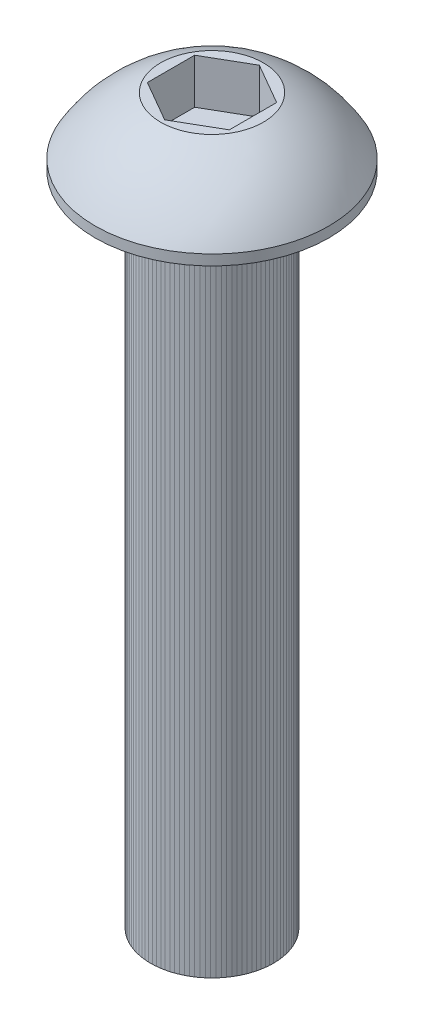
ISO-10303-21;
HEADER;
FILE_DESCRIPTION(('STEP AP214'),'2;1');
FILE_NAME('part.step','',(''),(''),'','','');
FILE_SCHEMA(('AUTOMOTIVE_DESIGN { 1 0 10303 214 1 1 1 1 }'));
ENDSEC;
DATA;
#1=APPLICATION_CONTEXT('core data for automotive mechanical design processes');
#2=APPLICATION_PROTOCOL_DEFINITION('international standard','automotive_design',2000,#1);
#3=PRODUCT_CONTEXT('',#1,'mechanical');
#4=PRODUCT('Part','Part','',(#3));
#5=PRODUCT_RELATED_PRODUCT_CATEGORY('part','',(#4));
#6=PRODUCT_DEFINITION_FORMATION('','',#4);
#7=PRODUCT_DEFINITION_CONTEXT('part definition',#1,'design');
#8=PRODUCT_DEFINITION('design','',#6,#7);
#9=PRODUCT_DEFINITION_SHAPE('','',#8);
#10=(LENGTH_UNIT() NAMED_UNIT(*) SI_UNIT(.MILLI.,.METRE.));
#11=(NAMED_UNIT(*) PLANE_ANGLE_UNIT() SI_UNIT($,.RADIAN.));
#12=(NAMED_UNIT(*) SI_UNIT($,.STERADIAN.) SOLID_ANGLE_UNIT());
#13=UNCERTAINTY_MEASURE_WITH_UNIT(LENGTH_MEASURE(1.E-05),#10,'distance_accuracy_value','');
#14=(GEOMETRIC_REPRESENTATION_CONTEXT(3) GLOBAL_UNCERTAINTY_ASSIGNED_CONTEXT((#13)) GLOBAL_UNIT_ASSIGNED_CONTEXT((#10,
#11,#12)) REPRESENTATION_CONTEXT('',''));
#15=CARTESIAN_POINT('',(0.,0.,0.));
#16=DIRECTION('',(0.,0.,1.));
#17=DIRECTION('',(1.,0.,0.));
#18=AXIS2_PLACEMENT_3D('',#15,#16,#17);
#19=CARTESIAN_POINT('',(0.,-16.,0.));
#20=DIRECTION('',(0.,1.,0.));
#21=DIRECTION('',(0.,0.,1.));
#22=AXIS2_PLACEMENT_3D('',#19,#20,#21);
#23=CYLINDRICAL_SURFACE('',#22,1.5);
#24=CARTESIAN_POINT('',(0.,0.,0.));
#25=DIRECTION('',(0.,1.,0.));
#26=DIRECTION('',(0.,0.,1.));
#27=AXIS2_PLACEMENT_3D('',#24,#25,#26);
#28=CIRCLE('',#27,1.5);
#29=CARTESIAN_POINT('',(0.,0.,1.5));
#30=VERTEX_POINT('',#29);
#31=EDGE_CURVE('P0_E16',#30,#30,#28,.F.);
#32=ORIENTED_EDGE('',*,*,#31,.T.);
#33=EDGE_LOOP('',(#32));
#34=FACE_BOUND('',#33,.T.);
#35=CARTESIAN_POINT('',(0.,-16.,0.));
#36=DIRECTION('',(0.,1.,0.));
#37=DIRECTION('',(0.,0.,1.));
#38=AXIS2_PLACEMENT_3D('',#35,#36,#37);
#39=CIRCLE('',#38,1.5);
#40=CARTESIAN_POINT('',(0.,-16.,1.5));
#41=VERTEX_POINT('',#40);
#42=EDGE_CURVE('P0_E10',#41,#41,#39,.T.);
#43=ORIENTED_EDGE('',*,*,#42,.T.);
#44=EDGE_LOOP('',(#43));
#45=FACE_BOUND('',#44,.T.);
#46=ADVANCED_FACE('P0_F15',(#34,#45),#23,.T.);
#47=OPEN_SHELL('',(#46));
#48=SHELL_BASED_SURFACE_MODEL('P0_B1',(#47));
#49=CARTESIAN_POINT('',(0.,0.55,0.));
#50=DIRECTION('',(0.,1.,0.));
#51=DIRECTION('',(0.,0.,1.));
#52=AXIS2_PLACEMENT_3D('',#49,#50,#51);
#53=PLANE('',#52);
#54=DIRECTION('',(0.866025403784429,0.,0.500000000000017));
#55=VECTOR('',#54,1.);
#56=CARTESIAN_POINT('',(-1.,0.55,0.5773502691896));
#57=LINE('',#56,#55);
#58=CARTESIAN_POINT('',(-1.,0.55,0.5773502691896));
#59=VERTEX_POINT('',#58);
#60=CARTESIAN_POINT('',(0.,0.55,1.15470053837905));
#61=VERTEX_POINT('',#60);
#62=EDGE_CURVE('P1_E92',#59,#61,#57,.T.);
#63=ORIENTED_EDGE('',*,*,#62,.T.);
#64=DIRECTION('',(0.866025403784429,0.,-0.500000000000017));
#65=VECTOR('',#64,1.);
#66=CARTESIAN_POINT('',(0.,0.55,1.154700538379));
#67=LINE('',#66,#65);
#68=CARTESIAN_POINT('',(0.999999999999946,0.55,0.577350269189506));
#69=VERTEX_POINT('',#68);
#70=EDGE_CURVE('P1_E89',#61,#69,#67,.T.);
#71=ORIENTED_EDGE('',*,*,#70,.T.);
#72=DIRECTION('',(0.,0.,-1.));
#73=VECTOR('',#72,1.);
#74=CARTESIAN_POINT('',(1.,0.55,0.5773502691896));
#75=LINE('',#74,#73);
#76=CARTESIAN_POINT('',(1.,0.55,-0.5773502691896));
#77=VERTEX_POINT('',#76);
#78=EDGE_CURVE('P1_E86',#69,#77,#75,.T.);
#79=ORIENTED_EDGE('',*,*,#78,.T.);
#80=DIRECTION('',(-0.866025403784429,0.,-0.500000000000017));
#81=VECTOR('',#80,1.);
#82=CARTESIAN_POINT('',(1.,0.55,-0.5773502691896));
#83=LINE('',#82,#81);
#84=CARTESIAN_POINT('',(0.,0.55,-1.15470053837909));
#85=VERTEX_POINT('',#84);
#86=EDGE_CURVE('P1_E115',#77,#85,#83,.T.);
#87=ORIENTED_EDGE('',*,*,#86,.T.);
#88=DIRECTION('',(-0.866025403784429,0.,0.500000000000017));
#89=VECTOR('',#88,1.);
#90=CARTESIAN_POINT('',(0.,0.55,-1.154700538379));
#91=LINE('',#90,#89);
#92=CARTESIAN_POINT('',(-0.999999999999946,0.55,-0.577350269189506));
#93=VERTEX_POINT('',#92);
#94=EDGE_CURVE('P1_E170',#85,#93,#91,.T.);
#95=ORIENTED_EDGE('',*,*,#94,.T.);
#96=DIRECTION('',(0.,0.,1.));
#97=VECTOR('',#96,1.);
#98=CARTESIAN_POINT('',(-1.,0.55,-0.5773502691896));
#99=LINE('',#98,#97);
#100=EDGE_CURVE('P1_E164',#93,#59,#99,.T.);
#101=ORIENTED_EDGE('',*,*,#100,.T.);
#102=EDGE_LOOP('',(#63,#71,#79,#87,#95,#101));
#103=FACE_BOUND('',#102,.T.);
#104=ADVANCED_FACE('P1_F17',(#103),#53,.T.);
#105=CARTESIAN_POINT('',(0.,1.65,1.154700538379));
#106=DIRECTION('',(0.500000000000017,0.,0.866025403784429));
#107=DIRECTION('',(0.866025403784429,0.,-0.500000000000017));
#108=AXIS2_PLACEMENT_3D('',#105,#106,#107);
#109=PLANE('',#108);
#110=ORIENTED_EDGE('',*,*,#70,.F.);
#111=DIRECTION('',(0.,1.,0.));
#112=VECTOR('',#111,1.);
#113=CARTESIAN_POINT('',(-1.08637057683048E-13,1.65,1.15470053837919));
#114=LINE('',#113,#112);
#115=CARTESIAN_POINT('',(0.,1.65,1.15470053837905));
#116=VERTEX_POINT('',#115);
#117=EDGE_CURVE('P1_E156',#61,#116,#114,.T.);
#118=ORIENTED_EDGE('',*,*,#117,.T.);
#119=DIRECTION('',(0.866025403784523,0.,-0.499999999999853));
#120=VECTOR('',#119,1.);
#121=CARTESIAN_POINT('',(0.,1.65,1.154700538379));
#122=LINE('',#121,#120);
#123=CARTESIAN_POINT('',(0.999999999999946,1.65,0.577350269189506));
#124=VERTEX_POINT('',#123);
#125=EDGE_CURVE('P1_E101',#116,#124,#122,.T.);
#126=ORIENTED_EDGE('',*,*,#125,.T.);
#127=DIRECTION('',(0.,1.,0.));
#128=VECTOR('',#127,1.);
#129=CARTESIAN_POINT('',(1.,1.65,0.5773502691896));
#130=LINE('',#129,#128);
#131=EDGE_CURVE('P1_E96',#124,#69,#130,.F.);
#132=ORIENTED_EDGE('',*,*,#131,.T.);
#133=EDGE_LOOP('',(#110,#118,#126,#132));
#134=FACE_BOUND('',#133,.T.);
#135=ADVANCED_FACE('P1_F99',(#134),#109,.F.);
#136=CARTESIAN_POINT('',(1.,1.65,0.5773502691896));
#137=DIRECTION('',(1.,0.,0.));
#138=DIRECTION('',(0.,0.,-1.));
#139=AXIS2_PLACEMENT_3D('',#136,#137,#138);
#140=PLANE('',#139);
#141=ORIENTED_EDGE('',*,*,#78,.F.);
#142=ORIENTED_EDGE('',*,*,#131,.F.);
#143=DIRECTION('',(0.,0.,-1.));
#144=VECTOR('',#143,1.);
#145=CARTESIAN_POINT('',(1.,1.65,0.));
#146=LINE('',#145,#144);
#147=CARTESIAN_POINT('',(1.,1.65,-0.5773502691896));
#148=VERTEX_POINT('',#147);
#149=EDGE_CURVE('P1_E151',#124,#148,#146,.T.);
#150=ORIENTED_EDGE('',*,*,#149,.T.);
#151=DIRECTION('',(0.,1.,0.));
#152=VECTOR('',#151,1.);
#153=CARTESIAN_POINT('',(1.,1.65,-0.5773502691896));
#154=LINE('',#153,#152);
#155=EDGE_CURVE('P1_E108',#148,#77,#154,.F.);
#156=ORIENTED_EDGE('',*,*,#155,.T.);
#157=EDGE_LOOP('',(#141,#142,#150,#156));
#158=FACE_BOUND('',#157,.T.);
#159=ADVANCED_FACE('P1_F106',(#158),#140,.F.);
#160=CARTESIAN_POINT('',(1.,1.65,-0.5773502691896));
#161=DIRECTION('',(0.500000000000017,0.,-0.866025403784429));
#162=DIRECTION('',(-0.866025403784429,0.,-0.500000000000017));
#163=AXIS2_PLACEMENT_3D('',#160,#161,#162);
#164=PLANE('',#163);
#165=ORIENTED_EDGE('',*,*,#86,.F.);
#166=ORIENTED_EDGE('',*,*,#155,.F.);
#167=DIRECTION('',(-0.866025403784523,0.,-0.499999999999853));
#168=VECTOR('',#167,1.);
#169=CARTESIAN_POINT('',(1.,1.65,-0.5773502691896));
#170=LINE('',#169,#168);
#171=CARTESIAN_POINT('',(0.,1.65,-1.15470053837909));
#172=VERTEX_POINT('',#171);
#173=EDGE_CURVE('P1_E148',#148,#172,#170,.T.);
#174=ORIENTED_EDGE('',*,*,#173,.T.);
#175=DIRECTION('',(0.,1.,0.));
#176=VECTOR('',#175,1.);
#177=CARTESIAN_POINT('',(0.,1.65,-1.154700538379));
#178=LINE('',#177,#176);
#179=EDGE_CURVE('P1_E173',#172,#85,#178,.F.);
#180=ORIENTED_EDGE('',*,*,#179,.T.);
#181=EDGE_LOOP('',(#165,#166,#174,#180));
#182=FACE_BOUND('',#181,.T.);
#183=ADVANCED_FACE('P1_F180',(#182),#164,.F.);
#184=CARTESIAN_POINT('',(0.,1.65,-1.154700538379));
#185=DIRECTION('',(-0.500000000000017,0.,-0.866025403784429));
#186=DIRECTION('',(-0.866025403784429,0.,0.500000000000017));
#187=AXIS2_PLACEMENT_3D('',#184,#185,#186);
#188=PLANE('',#187);
#189=ORIENTED_EDGE('',*,*,#94,.F.);
#190=ORIENTED_EDGE('',*,*,#179,.F.);
#191=DIRECTION('',(-0.866025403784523,0.,0.499999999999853));
#192=VECTOR('',#191,1.);
#193=CARTESIAN_POINT('',(0.,1.65,-1.154700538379));
#194=LINE('',#193,#192);
#195=CARTESIAN_POINT('',(-0.999999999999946,1.65,-0.577350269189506));
#196=VERTEX_POINT('',#195);
#197=EDGE_CURVE('P1_E142',#172,#196,#194,.T.);
#198=ORIENTED_EDGE('',*,*,#197,.T.);
#199=DIRECTION('',(0.,1.,0.));
#200=VECTOR('',#199,1.);
#201=CARTESIAN_POINT('',(-1.,1.65,-0.5773502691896));
#202=LINE('',#201,#200);
#203=EDGE_CURVE('P1_E167',#196,#93,#202,.F.);
#204=ORIENTED_EDGE('',*,*,#203,.T.);
#205=EDGE_LOOP('',(#189,#190,#198,#204));
#206=FACE_BOUND('',#205,.T.);
#207=ADVANCED_FACE('P1_F184',(#206),#188,.F.);
#208=CARTESIAN_POINT('',(-1.,1.65,-0.5773502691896));
#209=DIRECTION('',(-1.,0.,0.));
#210=DIRECTION('',(0.,0.,1.));
#211=AXIS2_PLACEMENT_3D('',#208,#209,#210);
#212=PLANE('',#211);
#213=ORIENTED_EDGE('',*,*,#100,.F.);
#214=ORIENTED_EDGE('',*,*,#203,.F.);
#215=DIRECTION('',(0.,0.,-1.));
#216=VECTOR('',#215,1.);
#217=CARTESIAN_POINT('',(-1.,1.65,0.));
#218=LINE('',#217,#216);
#219=CARTESIAN_POINT('',(-1.,1.65,0.5773502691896));
#220=VERTEX_POINT('',#219);
#221=EDGE_CURVE('P1_E44',#196,#220,#218,.F.);
#222=ORIENTED_EDGE('',*,*,#221,.T.);
#223=DIRECTION('',(0.,1.,0.));
#224=VECTOR('',#223,1.);
#225=CARTESIAN_POINT('',(-1.,1.65,0.5773502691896));
#226=LINE('',#225,#224);
#227=EDGE_CURVE('P1_E161',#220,#59,#226,.F.);
#228=ORIENTED_EDGE('',*,*,#227,.T.);
#229=EDGE_LOOP('',(#213,#214,#222,#228));
#230=FACE_BOUND('',#229,.T.);
#231=ADVANCED_FACE('P1_F186',(#230),#212,.F.);
#232=CARTESIAN_POINT('',(-1.,1.65,0.5773502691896));
#233=DIRECTION('',(-0.500000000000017,0.,0.866025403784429));
#234=DIRECTION('',(0.866025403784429,0.,0.500000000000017));
#235=AXIS2_PLACEMENT_3D('',#232,#233,#234);
#236=PLANE('',#235);
#237=ORIENTED_EDGE('',*,*,#62,.F.);
#238=ORIENTED_EDGE('',*,*,#227,.F.);
#239=DIRECTION('',(0.866025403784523,0.,0.499999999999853));
#240=VECTOR('',#239,1.);
#241=CARTESIAN_POINT('',(-1.,1.65,0.5773502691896));
#242=LINE('',#241,#240);
#243=EDGE_CURVE('P1_E131',#220,#116,#242,.T.);
#244=ORIENTED_EDGE('',*,*,#243,.T.);
#245=ORIENTED_EDGE('',*,*,#117,.F.);
#246=EDGE_LOOP('',(#237,#238,#244,#245));
#247=FACE_BOUND('',#246,.T.);
#248=ADVANCED_FACE('P1_F187',(#247),#236,.F.);
#249=CARTESIAN_POINT('',(0.,1.65,0.));
#250=DIRECTION('',(0.,-1.,0.));
#251=DIRECTION('',(0.,0.,-1.));
#252=AXIS2_PLACEMENT_3D('',#249,#250,#251);
#253=PLANE('',#252);
#254=ORIENTED_EDGE('',*,*,#221,.F.);
#255=ORIENTED_EDGE('',*,*,#197,.F.);
#256=ORIENTED_EDGE('',*,*,#173,.F.);
#257=ORIENTED_EDGE('',*,*,#149,.F.);
#258=ORIENTED_EDGE('',*,*,#125,.F.);
#259=ORIENTED_EDGE('',*,*,#243,.F.);
#260=EDGE_LOOP('',(#254,#255,#256,#257,#258,#259));
#261=FACE_BOUND('',#260,.T.);
#262=CARTESIAN_POINT('',(-1.25470053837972,1.65,0.));
#263=CARTESIAN_POINT('',(-1.2546965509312,1.64999999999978,-0.070424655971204));
#264=CARTESIAN_POINT('',(-1.24873864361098,1.64999999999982,-0.140974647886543));
#265=CARTESIAN_POINT('',(-1.23101016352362,1.65000000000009,-0.245237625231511));
#266=CARTESIAN_POINT('',(-1.22361994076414,1.65000000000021,-0.279775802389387));
#267=CARTESIAN_POINT('',(-1.20595086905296,1.64999999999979,-0.348140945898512));
#268=CARTESIAN_POINT('',(-1.19566967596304,1.64999999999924,-0.381967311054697));
#269=CARTESIAN_POINT('',(-1.16063107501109,1.64999999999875,-0.481845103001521));
#270=CARTESIAN_POINT('',(-1.13164986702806,1.64999999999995,-0.546463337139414));
#271=CARTESIAN_POINT('',(-1.0632361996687,1.65000000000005,-0.669911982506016));
#272=CARTESIAN_POINT('',(-1.02380334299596,1.64999999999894,-0.728742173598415));
#273=CARTESIAN_POINT('',(-0.957707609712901,1.64999999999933,-0.811368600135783));
#274=CARTESIAN_POINT('',(-0.934500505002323,1.6499999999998,-0.837989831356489));
#275=CARTESIAN_POINT('',(-0.885952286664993,1.6500000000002,-0.889159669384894));
#276=CARTESIAN_POINT('',(-0.86061325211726,1.65000000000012,-0.913710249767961));
#277=CARTESIAN_POINT('',(-0.78160082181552,1.64999999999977,-0.984041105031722));
#278=CARTESIAN_POINT('',(-0.724917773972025,1.6499999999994,-1.02651836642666));
#279=CARTESIAN_POINT('',(-0.605255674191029,1.64999999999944,-1.10132851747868));
#280=CARTESIAN_POINT('',(-0.542276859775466,1.64999999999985,-1.13366178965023));
#281=CARTESIAN_POINT('',(-0.411777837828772,1.65000000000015,-1.18730210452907));
#282=CARTESIAN_POINT('',(-0.344257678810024,1.65000000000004,-1.20860926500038));
#283=CARTESIAN_POINT('',(-0.206600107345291,1.64999999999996,-1.23958383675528));
#284=CARTESIAN_POINT('',(-0.136462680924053,1.64999999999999,-1.24925118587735));
#285=CARTESIAN_POINT('',(0.00443971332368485,1.65000000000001,-1.2566745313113));
#286=CARTESIAN_POINT('',(0.075204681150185,1.65,-1.25443052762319));
#287=CARTESIAN_POINT('',(0.21535490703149,1.65,-1.23809206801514));
#288=CARTESIAN_POINT('',(0.284740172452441,1.65,-1.22399767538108));
#289=CARTESIAN_POINT('',(0.42015312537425,1.65,-1.18436674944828));
#290=CARTESIAN_POINT('',(0.486180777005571,1.65,-1.1588300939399));
#291=CARTESIAN_POINT('',(0.613041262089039,1.65,-1.09700781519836));
#292=CARTESIAN_POINT('',(0.673873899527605,1.65,-1.06072178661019));
#293=CARTESIAN_POINT('',(0.759839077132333,1.65,-0.999082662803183));
#294=CARTESIAN_POINT('',(0.787617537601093,1.65,-0.977330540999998));
#295=CARTESIAN_POINT('',(0.8412737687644,1.65,-0.931545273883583));
#296=CARTESIAN_POINT('',(0.867149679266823,1.64999999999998,-0.907509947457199));
#297=CARTESIAN_POINT('',(0.941561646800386,1.65000000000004,-0.832286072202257));
#298=CARTESIAN_POINT('',(0.986957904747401,1.6500000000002,-0.7779250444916));
#299=CARTESIAN_POINT('',(1.06796444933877,1.6499999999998,-0.662348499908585));
#300=CARTESIAN_POINT('',(1.1035751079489,1.64999999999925,-0.601133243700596));
#301=CARTESIAN_POINT('',(1.1489145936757,1.64999999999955,-0.505490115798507));
#302=CARTESIAN_POINT('',(1.16269324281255,1.64999999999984,-0.472931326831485));
#303=CARTESIAN_POINT('',(1.18744810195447,1.65000000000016,-0.406801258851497));
#304=CARTESIAN_POINT('',(1.19842657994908,1.65000000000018,-0.373230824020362));
#305=CARTESIAN_POINT('',(1.22701255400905,1.64999999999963,-0.271407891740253));
#306=CARTESIAN_POINT('',(1.24035065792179,1.64999999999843,-0.201874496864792));
#307=CARTESIAN_POINT('',(1.25006989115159,1.64999999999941,-0.109940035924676));
#308=CARTESIAN_POINT('',(1.25180488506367,1.64999999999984,-0.0879909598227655));
#309=CARTESIAN_POINT('',(1.25412083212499,1.65000000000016,-0.0440320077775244));
#310=CARTESIAN_POINT('',(1.25470178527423,1.65000000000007,-0.0220221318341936));
#311=CARTESIAN_POINT('',(1.2546965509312,1.64999999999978,0.0704246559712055));
#312=CARTESIAN_POINT('',(1.24873864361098,1.64999999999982,0.140974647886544));
#313=CARTESIAN_POINT('',(1.23101016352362,1.65000000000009,0.245237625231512));
#314=CARTESIAN_POINT('',(1.22361994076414,1.65000000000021,0.279775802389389));
#315=CARTESIAN_POINT('',(1.20595086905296,1.64999999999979,0.348140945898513));
#316=CARTESIAN_POINT('',(1.19566967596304,1.64999999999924,0.381967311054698));
#317=CARTESIAN_POINT('',(1.16063107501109,1.64999999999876,0.481845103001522));
#318=CARTESIAN_POINT('',(1.13164986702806,1.64999999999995,0.546463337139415));
#319=CARTESIAN_POINT('',(1.0632361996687,1.65000000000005,0.669911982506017));
#320=CARTESIAN_POINT('',(1.02380334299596,1.64999999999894,0.728742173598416));
#321=CARTESIAN_POINT('',(0.9577076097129,1.64999999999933,0.811368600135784));
#322=CARTESIAN_POINT('',(0.934500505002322,1.6499999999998,0.83798983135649));
#323=CARTESIAN_POINT('',(0.885952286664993,1.6500000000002,0.889159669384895));
#324=CARTESIAN_POINT('',(0.860613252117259,1.65000000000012,0.913710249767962));
#325=CARTESIAN_POINT('',(0.781600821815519,1.64999999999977,0.984041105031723));
#326=CARTESIAN_POINT('',(0.724917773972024,1.6499999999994,1.02651836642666));
#327=CARTESIAN_POINT('',(0.605255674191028,1.64999999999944,1.10132851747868));
#328=CARTESIAN_POINT('',(0.542276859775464,1.64999999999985,1.13366178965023));
#329=CARTESIAN_POINT('',(0.411777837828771,1.65000000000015,1.18730210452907));
#330=CARTESIAN_POINT('',(0.344257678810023,1.65000000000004,1.20860926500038));
#331=CARTESIAN_POINT('',(0.20660010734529,1.64999999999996,1.23958383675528));
#332=CARTESIAN_POINT('',(0.136462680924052,1.64999999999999,1.24925118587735));
#333=CARTESIAN_POINT('',(-0.00443971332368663,1.65000000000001,1.2566745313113));
#334=CARTESIAN_POINT('',(-0.0752046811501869,1.65,1.25443052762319));
#335=CARTESIAN_POINT('',(-0.215354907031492,1.65,1.23809206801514));
#336=CARTESIAN_POINT('',(-0.284740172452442,1.65,1.22399767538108));
#337=CARTESIAN_POINT('',(-0.420153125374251,1.65,1.18436674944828));
#338=CARTESIAN_POINT('',(-0.486180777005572,1.65,1.1588300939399));
#339=CARTESIAN_POINT('',(-0.61304126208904,1.65,1.09700781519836));
#340=CARTESIAN_POINT('',(-0.673873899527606,1.65,1.06072178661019));
#341=CARTESIAN_POINT('',(-0.759839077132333,1.65,0.999082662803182));
#342=CARTESIAN_POINT('',(-0.787617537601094,1.65000000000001,0.977330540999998));
#343=CARTESIAN_POINT('',(-0.8412737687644,1.64999999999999,0.931545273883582));
#344=CARTESIAN_POINT('',(-0.867149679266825,1.64999999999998,0.907509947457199));
#345=CARTESIAN_POINT('',(-0.941561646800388,1.65000000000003,0.832286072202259));
#346=CARTESIAN_POINT('',(-0.986957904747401,1.6500000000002,0.7779250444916));
#347=CARTESIAN_POINT('',(-1.06796444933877,1.6499999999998,0.662348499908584));
#348=CARTESIAN_POINT('',(-1.10357510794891,1.64999999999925,0.601133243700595));
#349=CARTESIAN_POINT('',(-1.1489145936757,1.64999999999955,0.505490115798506));
#350=CARTESIAN_POINT('',(-1.16269324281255,1.64999999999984,0.472931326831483));
#351=CARTESIAN_POINT('',(-1.18744810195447,1.65000000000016,0.406801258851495));
#352=CARTESIAN_POINT('',(-1.19842657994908,1.65000000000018,0.373230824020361));
#353=CARTESIAN_POINT('',(-1.22701255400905,1.64999999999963,0.271407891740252));
#354=CARTESIAN_POINT('',(-1.24035065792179,1.64999999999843,0.20187449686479));
#355=CARTESIAN_POINT('',(-1.25006989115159,1.64999999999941,0.109940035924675));
#356=CARTESIAN_POINT('',(-1.25180488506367,1.64999999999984,0.0879909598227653));
#357=CARTESIAN_POINT('',(-1.25412083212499,1.65000000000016,0.0440320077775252));
#358=CARTESIAN_POINT('',(-1.25470178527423,1.65000000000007,0.0220221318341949));
#359=CARTESIAN_POINT('',(-1.25470053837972,1.65,0.));
#360=B_SPLINE_CURVE_WITH_KNOTS('',3,(#262,#263,#264,#265,#266,#267,#268,#269,#270,#271,#272,
#273,#274,#275,#276,#277,#278,#279,#280,#281,#282,#283,#284,#285,#286,#287,#288,#289,#290,#291,
#292,#293,#294,#295,#296,#297,#298,#299,#300,#301,#302,#303,#304,#305,#306,#307,#308,#309,#310,
#311,#312,#313,#314,#315,#316,#317,#318,#319,#320,#321,#322,#323,#324,#325,#326,#327,#328,#329,
#330,#331,#332,#333,#334,#335,#336,#337,#338,#339,#340,#341,#342,#343,#344,#345,#346,#347,#348,
#349,#350,#351,#352,#353,#354,#355,#356,#357,#358,#359),.UNSPECIFIED.,.T.,.F.,(4,2,2,2,2,2,2,2,
2,2,2,2,2,2,2,2,2,2,2,2,2,2,2,2,2,2,2,2,2,2,2,2,2,2,2,2,2,2,2,2,2,2,2,2,2,2,2,2,4),(0.,
0.211171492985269,0.317034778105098,0.422984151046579,0.634377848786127,0.84577958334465,
0.951618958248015,1.05735628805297,1.26876310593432,1.48016195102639,1.6915585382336,
1.90295625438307,2.1143539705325,2.32575055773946,2.53714940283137,2.74855622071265,
2.85429355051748,2.96013292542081,3.17153465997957,3.38292835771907,3.48887773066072,
3.59474101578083,3.80591250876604,3.87194685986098,3.93798121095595,4.14915270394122,
4.25501598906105,4.36096536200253,4.57235905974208,4.7837607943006,4.88960016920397,
4.99533749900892,5.20674431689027,5.41814316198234,5.62953974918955,5.84093746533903,
6.05233518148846,6.26373176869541,6.47513061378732,6.68653743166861,6.79227476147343,
6.89811413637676,7.10951587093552,7.32090956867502,7.42685894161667,7.53272222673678,
7.74389371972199,7.80992807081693,7.8759624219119),.UNSPECIFIED.);
#361=CARTESIAN_POINT('',(-1.25470053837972,1.65,0.));
#362=VERTEX_POINT('',#361);
#363=EDGE_CURVE('P1_E20',#362,#362,#360,.T.);
#364=ORIENTED_EDGE('',*,*,#363,.F.);
#365=EDGE_LOOP('',(#364));
#366=FACE_BOUND('',#365,.T.);
#367=ADVANCED_FACE('P1_F189',(#261,#366),#253,.F.);
#368=CARTESIAN_POINT('',(0.,-1.39317183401,0.));
#369=DIRECTION('',(-1.,0.,0.));
#370=DIRECTION('',(0.,0.,-1.));
#371=AXIS2_PLACEMENT_3D('',#368,#369,#370);
#372=SPHERICAL_SURFACE('',#371,3.291681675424);
#373=ORIENTED_EDGE('',*,*,#363,.T.);
#374=EDGE_LOOP('',(#373));
#375=FACE_BOUND('',#374,.T.);
#376=CARTESIAN_POINT('',(0.,0.2538461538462,0.));
#377=DIRECTION('',(0.,-1.,0.));
#378=DIRECTION('',(0.,0.,-1.));
#379=AXIS2_PLACEMENT_3D('',#376,#377,#378);
#380=CIRCLE('',#379,2.85);
#381=CARTESIAN_POINT('',(0.,0.2538461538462,-2.85));
#382=VERTEX_POINT('',#381);
#383=EDGE_CURVE('P1_E125',#382,#382,#380,.T.);
#384=ORIENTED_EDGE('',*,*,#383,.F.);
#385=EDGE_LOOP('',(#384));
#386=FACE_BOUND('',#385,.T.);
#387=ADVANCED_FACE('P1_F196',(#375,#386),#372,.T.);
#388=CARTESIAN_POINT('',(0.,1.993435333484,0.));
#389=DIRECTION('',(0.,-1.,0.));
#390=DIRECTION('',(0.,0.,-1.));
#391=AXIS2_PLACEMENT_3D('',#388,#389,#390);
#392=CYLINDRICAL_SURFACE('',#391,2.85);
#393=ORIENTED_EDGE('',*,*,#383,.T.);
#394=EDGE_LOOP('',(#393));
#395=FACE_BOUND('',#394,.T.);
#396=CARTESIAN_POINT('',(0.,0.,0.));
#397=DIRECTION('',(0.,-1.,0.));
#398=DIRECTION('',(0.,0.,-1.));
#399=AXIS2_PLACEMENT_3D('',#396,#397,#398);
#400=CIRCLE('',#399,2.85);
#401=CARTESIAN_POINT('',(0.,0.,-2.85));
#402=VERTEX_POINT('',#401);
#403=EDGE_CURVE('P1_E122',#402,#402,#400,.T.);
#404=ORIENTED_EDGE('',*,*,#403,.F.);
#405=EDGE_LOOP('',(#404));
#406=FACE_BOUND('',#405,.T.);
#407=ADVANCED_FACE('P1_F215',(#395,#406),#392,.T.);
#408=CARTESIAN_POINT('',(0.,-16.,0.));
#409=DIRECTION('',(0.,-1.,0.));
#410=DIRECTION('',(0.,0.,-1.));
#411=AXIS2_PLACEMENT_3D('',#408,#409,#410);
#412=PLANE('',#411);
#413=CARTESIAN_POINT('',(0.,-16.,0.));
#414=DIRECTION('',(0.,-1.,0.));
#415=DIRECTION('',(0.,0.,-1.));
#416=AXIS2_PLACEMENT_3D('',#413,#414,#415);
#417=CIRCLE('',#416,1.5);
#418=CARTESIAN_POINT('',(0.,-16.,-1.5));
#419=VERTEX_POINT('',#418);
#420=EDGE_CURVE('P1_E31',#419,#419,#417,.F.);
#421=ORIENTED_EDGE('',*,*,#420,.F.);
#422=EDGE_LOOP('',(#421));
#423=FACE_BOUND('',#422,.T.);
#424=ADVANCED_FACE('P1_F208',(#423),#412,.T.);
#425=CARTESIAN_POINT('',(0.,0.,0.));
#426=DIRECTION('',(0.,-1.,0.));
#427=DIRECTION('',(0.,0.,-1.));
#428=AXIS2_PLACEMENT_3D('',#425,#426,#427);
#429=PLANE('',#428);
#430=CARTESIAN_POINT('',(0.,0.,0.));
#431=DIRECTION('',(0.,-1.,0.));
#432=DIRECTION('',(0.,0.,-1.));
#433=AXIS2_PLACEMENT_3D('',#430,#431,#432);
#434=CIRCLE('',#433,1.5);
#435=CARTESIAN_POINT('',(0.,0.,-1.5));
#436=VERTEX_POINT('',#435);
#437=EDGE_CURVE('P1_E11',#436,#436,#434,.T.);
#438=ORIENTED_EDGE('',*,*,#437,.F.);
#439=EDGE_LOOP('',(#438));
#440=FACE_BOUND('',#439,.T.);
#441=ORIENTED_EDGE('',*,*,#403,.T.);
#442=EDGE_LOOP('',(#441));
#443=FACE_BOUND('',#442,.T.);
#444=ADVANCED_FACE('P1_F201',(#440,#443),#429,.T.);
#445=CARTESIAN_POINT('',(0.,0.,0.));
#446=DIRECTION('',(0.,-1.,0.));
#447=DIRECTION('',(0.,0.,-1.));
#448=AXIS2_PLACEMENT_3D('',#445,#446,#447);
#449=CYLINDRICAL_SURFACE('',#448,1.5);
#450=ORIENTED_EDGE('',*,*,#420,.T.);
#451=EDGE_LOOP('',(#450));
#452=FACE_BOUND('',#451,.T.);
#453=ORIENTED_EDGE('',*,*,#437,.T.);
#454=EDGE_LOOP('',(#453));
#455=FACE_BOUND('',#454,.T.);
#456=ADVANCED_FACE('P1_F199',(#452,#455),#449,.T.);
#457=CLOSED_SHELL('',(#104,#135,#159,#183,#207,#231,#248,#367,#387,#407,#424,#444,#456));
#458=MANIFOLD_SOLID_BREP('P1_B1',#457);
#459=ADVANCED_BREP_SHAPE_REPRESENTATION('',(#18,#458),#14);
#460=MANIFOLD_SURFACE_SHAPE_REPRESENTATION('',(#18,#48),#14);
#461=SHAPE_REPRESENTATION('',(#18),#14);
#462=SHAPE_DEFINITION_REPRESENTATION(#9,#461);
#463=SHAPE_REPRESENTATION_RELATIONSHIP('','',#461,#459);
#464=SHAPE_REPRESENTATION_RELATIONSHIP('','',#461,#460);
ENDSEC;
END-ISO-10303-21;
